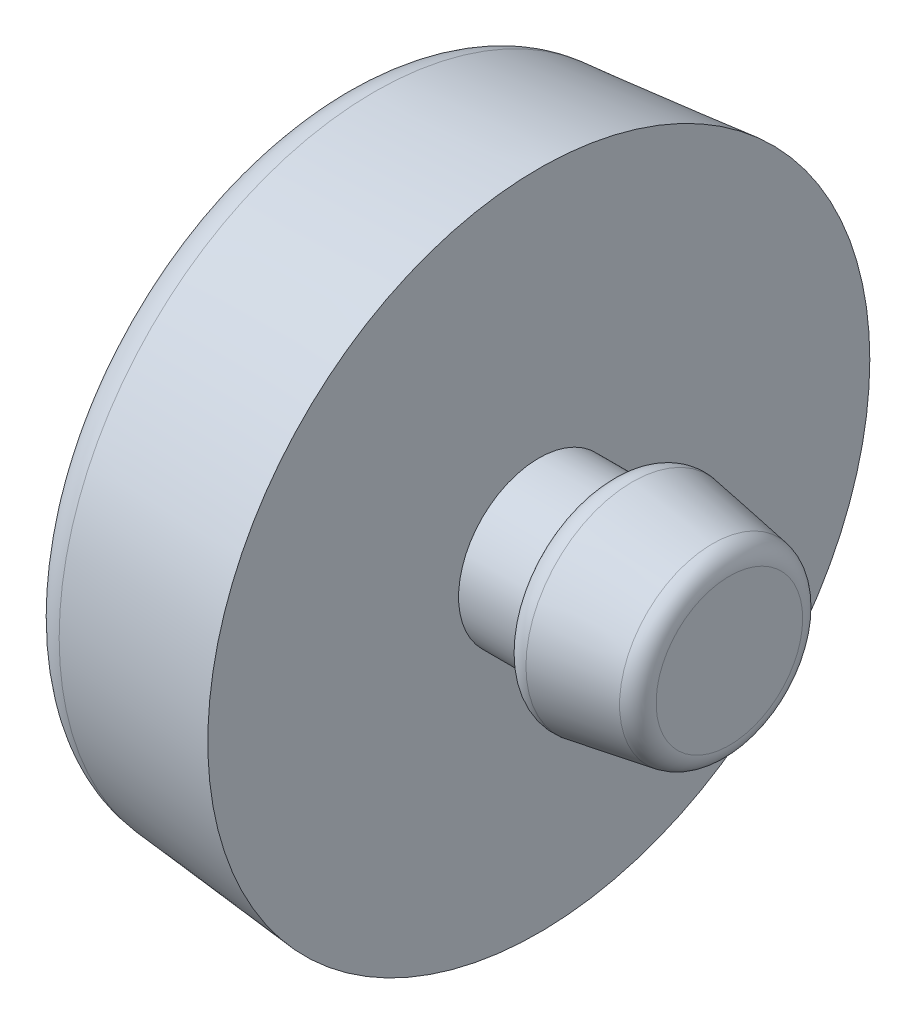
from build123d import *

# Parameters (mm, degrees)
CONG_1_R                = 1
ESQUISSE2_R             = 16.5
ENL_V_MAT_EXTRU_1_DEPTH = 0.5
CONG_2_R                = 2


with BuildPart() as part:
    # Esquisse1 → Base-R_volution (revolve)
    with BuildSketch(Plane.XY, mode=Mode.PRIVATE) as base_r_volution_sk:
        Polygon((-11, 0), (-11, 15.5), (-0.5, 16.5), (-0.5, 4), (3, 4), (3, 5.5), (9, 4.5), (9, 0), align=None)
    revolve(base_r_volution_sk.sketch.rotate(Axis((57, 0, 0), (-1, 0, 0)), 90), axis=Axis((57, 0, 0), (-1, 0, 0)))

    # Cong_1
    cong_1_edges = [part.edges().sort_by_distance(p)[0] for p in [
        (9, 0, 4.5),
        (3, 0, 5.5),
    ]]
    fillet(cong_1_edges, radius=CONG_1_R)

    # Esquisse2 → Enl_v. mat.-Extru.1 (cut)
    with BuildSketch(Plane.ZY.offset(11)):
        Circle(ESQUISSE2_R)
    extrude(amount=-ENL_V_MAT_EXTRU_1_DEPTH, mode=Mode.SUBTRACT)

    # Cong_2
    cong_2_edges = [part.edges().sort_by_distance(p)[0] for p in [
        (-10.5, 0, 15.547619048),
    ]]
    fillet(cong_2_edges, radius=CONG_2_R)


solid = part.part
